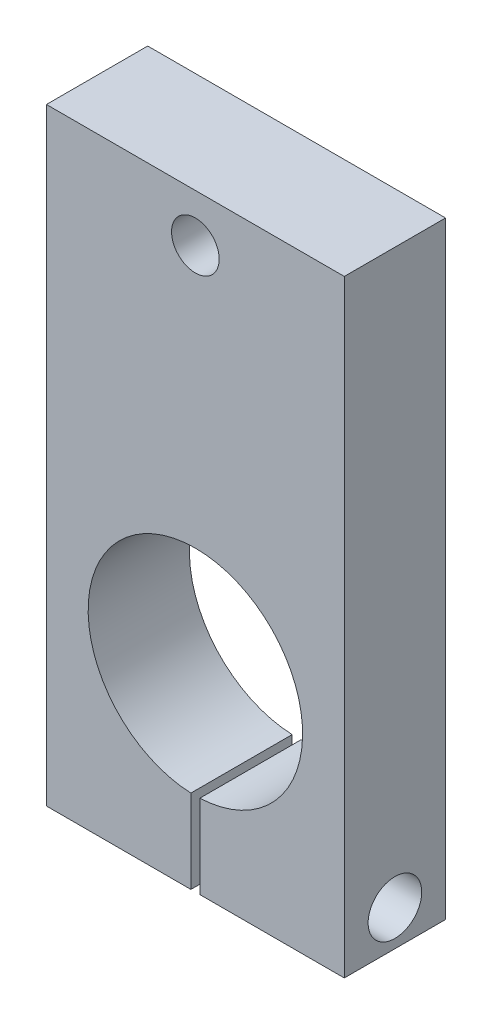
ISO-10303-21;
HEADER;
FILE_DESCRIPTION(('STEP AP214'),'2;1');
FILE_NAME('part.step','',(''),(''),'','','');
FILE_SCHEMA(('AUTOMOTIVE_DESIGN { 1 0 10303 214 1 1 1 1 }'));
ENDSEC;
DATA;
#1=APPLICATION_CONTEXT('core data for automotive mechanical design processes');
#2=APPLICATION_PROTOCOL_DEFINITION('international standard','automotive_design',2000,#1);
#3=PRODUCT_CONTEXT('',#1,'mechanical');
#4=PRODUCT('Part','Part','',(#3));
#5=PRODUCT_RELATED_PRODUCT_CATEGORY('part','',(#4));
#6=PRODUCT_DEFINITION_FORMATION('','',#4);
#7=PRODUCT_DEFINITION_CONTEXT('part definition',#1,'design');
#8=PRODUCT_DEFINITION('design','',#6,#7);
#9=PRODUCT_DEFINITION_SHAPE('','',#8);
#10=(LENGTH_UNIT() NAMED_UNIT(*) SI_UNIT(.MILLI.,.METRE.));
#11=(NAMED_UNIT(*) PLANE_ANGLE_UNIT() SI_UNIT($,.RADIAN.));
#12=(NAMED_UNIT(*) SI_UNIT($,.STERADIAN.) SOLID_ANGLE_UNIT());
#13=UNCERTAINTY_MEASURE_WITH_UNIT(LENGTH_MEASURE(1.E-05),#10,'distance_accuracy_value','');
#14=(GEOMETRIC_REPRESENTATION_CONTEXT(3) GLOBAL_UNCERTAINTY_ASSIGNED_CONTEXT((#13)) GLOBAL_UNIT_ASSIGNED_CONTEXT((#10,
#11,#12)) REPRESENTATION_CONTEXT('',''));
#15=CARTESIAN_POINT('',(0.,0.,0.));
#16=DIRECTION('',(0.,0.,1.));
#17=DIRECTION('',(1.,0.,0.));
#18=AXIS2_PLACEMENT_3D('',#15,#16,#17);
#19=CARTESIAN_POINT('',(12.,-26.,8.5));
#20=DIRECTION('',(-1.,0.,0.));
#21=DIRECTION('',(0.,-1.,0.));
#22=AXIS2_PLACEMENT_3D('',#19,#20,#21);
#23=PLANE('',#22);
#24=CARTESIAN_POINT('',(12.,-26.,8.5));
#25=DIRECTION('',(1.,0.,0.));
#26=DIRECTION('',(0.,1.,0.));
#27=AXIS2_PLACEMENT_3D('',#24,#25,#26);
#28=CIRCLE('',#27,3.);
#29=CARTESIAN_POINT('',(12.,-23.,8.5));
#30=VERTEX_POINT('',#29);
#31=EDGE_CURVE('E20',#30,#30,#28,.F.);
#32=ORIENTED_EDGE('',*,*,#31,.T.);
#33=EDGE_LOOP('',(#32));
#34=FACE_BOUND('',#33,.T.);
#35=CARTESIAN_POINT('',(12.,-26.,8.5));
#36=DIRECTION('',(1.,0.,0.));
#37=DIRECTION('',(0.,1.,0.));
#38=AXIS2_PLACEMENT_3D('',#35,#36,#37);
#39=CIRCLE('',#38,4.5);
#40=CARTESIAN_POINT('',(12.,-21.5,8.5));
#41=VERTEX_POINT('',#40);
#42=EDGE_CURVE('E179',#41,#41,#39,.T.);
#43=ORIENTED_EDGE('',*,*,#42,.T.);
#44=EDGE_LOOP('',(#43));
#45=FACE_BOUND('',#44,.T.);
#46=ADVANCED_FACE('F16',(#34,#45),#23,.F.);
#47=CARTESIAN_POINT('',(12.5,-26.,8.5));
#48=DIRECTION('',(1.,0.,0.));
#49=DIRECTION('',(0.,1.,0.));
#50=AXIS2_PLACEMENT_3D('',#47,#48,#49);
#51=CYLINDRICAL_SURFACE('',#50,3.);
#52=ORIENTED_EDGE('',*,*,#31,.F.);
#53=EDGE_LOOP('',(#52));
#54=FACE_BOUND('',#53,.T.);
#55=CARTESIAN_POINT('',(0.750000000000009,-26.,8.5));
#56=DIRECTION('',(1.,0.,0.));
#57=DIRECTION('',(0.,1.,0.));
#58=AXIS2_PLACEMENT_3D('',#55,#56,#57);
#59=CIRCLE('',#58,3.);
#60=CARTESIAN_POINT('',(0.750000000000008,-23.,8.5));
#61=VERTEX_POINT('',#60);
#62=EDGE_CURVE('E109',#61,#61,#59,.T.);
#63=ORIENTED_EDGE('',*,*,#62,.F.);
#64=EDGE_LOOP('',(#63));
#65=FACE_BOUND('',#64,.T.);
#66=ADVANCED_FACE('F187',(#54,#65),#51,.F.);
#67=CARTESIAN_POINT('',(18.5,-26.,8.5));
#68=DIRECTION('',(1.,0.,0.));
#69=DIRECTION('',(0.,1.,0.));
#70=AXIS2_PLACEMENT_3D('',#67,#68,#69);
#71=CYLINDRICAL_SURFACE('',#70,4.5);
#72=CARTESIAN_POINT('',(25.,-26.,8.5));
#73=DIRECTION('',(1.,0.,0.));
#74=DIRECTION('',(0.,1.,0.));
#75=AXIS2_PLACEMENT_3D('',#72,#73,#74);
#76=CIRCLE('',#75,4.5);
#77=CARTESIAN_POINT('',(25.,-21.5,8.5));
#78=VERTEX_POINT('',#77);
#79=EDGE_CURVE('E149',#78,#78,#76,.F.);
#80=ORIENTED_EDGE('',*,*,#79,.F.);
#81=EDGE_LOOP('',(#80));
#82=FACE_BOUND('',#81,.T.);
#83=ORIENTED_EDGE('',*,*,#42,.F.);
#84=EDGE_LOOP('',(#83));
#85=FACE_BOUND('',#84,.T.);
#86=ADVANCED_FACE('F190',(#82,#85),#71,.F.);
#87=CARTESIAN_POINT('',(-12.5,-26.,8.5));
#88=DIRECTION('',(-1.,0.,0.));
#89=DIRECTION('',(0.,-1.,0.));
#90=AXIS2_PLACEMENT_3D('',#87,#88,#89);
#91=CYLINDRICAL_SURFACE('',#90,2.067);
#92=CARTESIAN_POINT('',(-25.,-26.,8.5));
#93=DIRECTION('',(-1.,0.,0.));
#94=DIRECTION('',(0.,-1.,0.));
#95=AXIS2_PLACEMENT_3D('',#92,#93,#94);
#96=CIRCLE('',#95,2.067);
#97=CARTESIAN_POINT('',(-25.,-28.067,8.5));
#98=VERTEX_POINT('',#97);
#99=EDGE_CURVE('E132',#98,#98,#96,.F.);
#100=ORIENTED_EDGE('',*,*,#99,.F.);
#101=EDGE_LOOP('',(#100));
#102=FACE_BOUND('',#101,.T.);
#103=CARTESIAN_POINT('',(-0.749999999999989,-26.,8.5));
#104=DIRECTION('',(-1.,0.,0.));
#105=DIRECTION('',(0.,-1.,0.));
#106=AXIS2_PLACEMENT_3D('',#103,#104,#105);
#107=CIRCLE('',#106,2.067);
#108=CARTESIAN_POINT('',(-0.749999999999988,-28.067,8.5));
#109=VERTEX_POINT('',#108);
#110=EDGE_CURVE('E103',#109,#109,#107,.T.);
#111=ORIENTED_EDGE('',*,*,#110,.F.);
#112=EDGE_LOOP('',(#111));
#113=FACE_BOUND('',#112,.T.);
#114=ADVANCED_FACE('F226',(#102,#113),#91,.F.);
#115=CARTESIAN_POINT('',(0.,11.2291808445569,17.));
#116=DIRECTION('',(0.,0.,1.));
#117=DIRECTION('',(1.,0.,0.));
#118=AXIS2_PLACEMENT_3D('',#115,#116,#117);
#119=PLANE('',#118);
#120=DIRECTION('',(0.,1.,0.));
#121=VECTOR('',#120,1.);
#122=CARTESIAN_POINT('',(25.,70.,17.));
#123=LINE('',#122,#121);
#124=CARTESIAN_POINT('',(25.,70.,17.));
#125=VERTEX_POINT('',#124);
#126=CARTESIAN_POINT('',(25.,-32.,17.));
#127=VERTEX_POINT('',#126);
#128=EDGE_CURVE('E147',#125,#127,#123,.F.);
#129=ORIENTED_EDGE('',*,*,#128,.F.);
#130=DIRECTION('',(1.,0.,0.));
#131=VECTOR('',#130,1.);
#132=CARTESIAN_POINT('',(-25.,70.,17.));
#133=LINE('',#132,#131);
#134=CARTESIAN_POINT('',(-25.,70.,17.));
#135=VERTEX_POINT('',#134);
#136=EDGE_CURVE('E138',#135,#125,#133,.T.);
#137=ORIENTED_EDGE('',*,*,#136,.F.);
#138=DIRECTION('',(0.,-1.,0.));
#139=VECTOR('',#138,1.);
#140=CARTESIAN_POINT('',(-25.,-32.,17.));
#141=LINE('',#140,#139);
#142=CARTESIAN_POINT('',(-25.,-32.,17.));
#143=VERTEX_POINT('',#142);
#144=EDGE_CURVE('E130',#143,#135,#141,.F.);
#145=ORIENTED_EDGE('',*,*,#144,.F.);
#146=DIRECTION('',(1.,0.,0.));
#147=VECTOR('',#146,1.);
#148=CARTESIAN_POINT('',(-0.749999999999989,-32.,17.));
#149=LINE('',#148,#147);
#150=CARTESIAN_POINT('',(-0.749999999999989,-32.,17.));
#151=VERTEX_POINT('',#150);
#152=EDGE_CURVE('E99',#151,#143,#149,.F.);
#153=ORIENTED_EDGE('',*,*,#152,.F.);
#154=DIRECTION('',(0.,1.,0.));
#155=VECTOR('',#154,1.);
#156=CARTESIAN_POINT('',(-0.74999999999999,-17.9843682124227,17.));
#157=LINE('',#156,#155);
#158=CARTESIAN_POINT('',(-0.749999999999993,-17.9843682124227,17.));
#159=VERTEX_POINT('',#158);
#160=EDGE_CURVE('E92',#159,#151,#157,.F.);
#161=ORIENTED_EDGE('',*,*,#160,.F.);
#162=CARTESIAN_POINT('',(0.,0.,17.));
#163=DIRECTION('',(0.,0.,1.));
#164=DIRECTION('',(1.,0.,0.));
#165=AXIS2_PLACEMENT_3D('',#162,#163,#164);
#166=CIRCLE('',#165,18.);
#167=CARTESIAN_POINT('',(0.750000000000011,-17.9843682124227,17.));
#168=VERTEX_POINT('',#167);
#169=EDGE_CURVE('E83',#168,#159,#166,.T.);
#170=ORIENTED_EDGE('',*,*,#169,.F.);
#171=DIRECTION('',(0.,-1.,0.));
#172=VECTOR('',#171,1.);
#173=CARTESIAN_POINT('',(0.750000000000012,-32.,17.));
#174=LINE('',#173,#172);
#175=CARTESIAN_POINT('',(0.750000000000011,-32.,17.));
#176=VERTEX_POINT('',#175);
#177=EDGE_CURVE('E78',#176,#168,#174,.F.);
#178=ORIENTED_EDGE('',*,*,#177,.F.);
#179=DIRECTION('',(1.,0.,0.));
#180=VECTOR('',#179,1.);
#181=CARTESIAN_POINT('',(25.,-32.,17.));
#182=LINE('',#181,#180);
#183=EDGE_CURVE('E155',#127,#176,#182,.F.);
#184=ORIENTED_EDGE('',*,*,#183,.F.);
#185=EDGE_LOOP('',(#129,#137,#145,#153,#161,#170,#178,#184));
#186=FACE_BOUND('',#185,.T.);
#187=CARTESIAN_POINT('',(0.,62.,17.));
#188=DIRECTION('',(0.,0.,1.));
#189=DIRECTION('',(1.,0.,0.));
#190=AXIS2_PLACEMENT_3D('',#187,#188,#189);
#191=CIRCLE('',#190,4.);
#192=CARTESIAN_POINT('',(4.,62.,17.));
#193=VERTEX_POINT('',#192);
#194=EDGE_CURVE('E177',#193,#193,#191,.F.);
#195=ORIENTED_EDGE('',*,*,#194,.T.);
#196=EDGE_LOOP('',(#195));
#197=FACE_BOUND('',#196,.T.);
#198=ADVANCED_FACE('F96',(#186,#197),#119,.T.);
#199=CARTESIAN_POINT('',(0.,62.,0.));
#200=DIRECTION('',(0.,0.,1.));
#201=DIRECTION('',(1.,0.,0.));
#202=AXIS2_PLACEMENT_3D('',#199,#200,#201);
#203=CYLINDRICAL_SURFACE('',#202,4.);
#204=CARTESIAN_POINT('',(0.,62.,0.));
#205=DIRECTION('',(0.,0.,1.));
#206=DIRECTION('',(1.,0.,0.));
#207=AXIS2_PLACEMENT_3D('',#204,#205,#206);
#208=CIRCLE('',#207,4.);
#209=CARTESIAN_POINT('',(4.,62.,0.));
#210=VERTEX_POINT('',#209);
#211=EDGE_CURVE('E119',#210,#210,#208,.F.);
#212=ORIENTED_EDGE('',*,*,#211,.T.);
#213=EDGE_LOOP('',(#212));
#214=FACE_BOUND('',#213,.T.);
#215=ORIENTED_EDGE('',*,*,#194,.F.);
#216=EDGE_LOOP('',(#215));
#217=FACE_BOUND('',#216,.T.);
#218=ADVANCED_FACE('F220',(#214,#217),#203,.F.);
#219=CARTESIAN_POINT('',(-0.74999999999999,-17.9843682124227,0.));
#220=DIRECTION('',(1.,0.,0.));
#221=DIRECTION('',(0.,0.,-1.));
#222=AXIS2_PLACEMENT_3D('',#219,#220,#221);
#223=PLANE('',#222);
#224=DIRECTION('',(0.,1.,0.));
#225=VECTOR('',#224,1.);
#226=CARTESIAN_POINT('',(-0.749999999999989,11.2291808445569,0.));
#227=LINE('',#226,#225);
#228=CARTESIAN_POINT('',(-0.749999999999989,-32.,0.));
#229=VERTEX_POINT('',#228);
#230=CARTESIAN_POINT('',(-0.749999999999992,-17.9843682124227,0.));
#231=VERTEX_POINT('',#230);
#232=EDGE_CURVE('E108',#229,#231,#227,.T.);
#233=ORIENTED_EDGE('',*,*,#232,.T.);
#234=DIRECTION('',(0.,0.,1.));
#235=VECTOR('',#234,1.);
#236=CARTESIAN_POINT('',(-0.749999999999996,-17.9843682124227,0.));
#237=LINE('',#236,#235);
#238=EDGE_CURVE('E88',#159,#231,#237,.F.);
#239=ORIENTED_EDGE('',*,*,#238,.F.);
#240=ORIENTED_EDGE('',*,*,#160,.T.);
#241=DIRECTION('',(0.,0.,1.));
#242=VECTOR('',#241,1.);
#243=CARTESIAN_POINT('',(-0.749999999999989,-32.,0.));
#244=LINE('',#243,#242);
#245=EDGE_CURVE('E117',#229,#151,#244,.T.);
#246=ORIENTED_EDGE('',*,*,#245,.F.);
#247=EDGE_LOOP('',(#233,#239,#240,#246));
#248=FACE_BOUND('',#247,.T.);
#249=ORIENTED_EDGE('',*,*,#110,.T.);
#250=EDGE_LOOP('',(#249));
#251=FACE_BOUND('',#250,.T.);
#252=ADVANCED_FACE('F106',(#248,#251),#223,.T.);
#253=CARTESIAN_POINT('',(0.,0.,0.));
#254=DIRECTION('',(0.,0.,1.));
#255=DIRECTION('',(1.,0.,0.));
#256=AXIS2_PLACEMENT_3D('',#253,#254,#255);
#257=CYLINDRICAL_SURFACE('',#256,18.);
#258=CARTESIAN_POINT('',(0.,0.,0.));
#259=DIRECTION('',(0.,0.,1.));
#260=DIRECTION('',(1.,0.,0.));
#261=AXIS2_PLACEMENT_3D('',#258,#259,#260);
#262=CIRCLE('',#261,18.);
#263=CARTESIAN_POINT('',(0.750000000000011,-17.9843682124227,0.));
#264=VERTEX_POINT('',#263);
#265=EDGE_CURVE('E166',#231,#264,#262,.F.);
#266=ORIENTED_EDGE('',*,*,#265,.T.);
#267=DIRECTION('',(0.,0.,1.));
#268=VECTOR('',#267,1.);
#269=CARTESIAN_POINT('',(0.750000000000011,-17.9843682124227,0.));
#270=LINE('',#269,#268);
#271=EDGE_CURVE('E90',#168,#264,#270,.F.);
#272=ORIENTED_EDGE('',*,*,#271,.F.);
#273=ORIENTED_EDGE('',*,*,#169,.T.);
#274=ORIENTED_EDGE('',*,*,#238,.T.);
#275=EDGE_LOOP('',(#266,#272,#273,#274));
#276=FACE_BOUND('',#275,.T.);
#277=ADVANCED_FACE('F86',(#276),#257,.F.);
#278=CARTESIAN_POINT('',(0.750000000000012,-32.,0.));
#279=DIRECTION('',(-1.,0.,0.));
#280=DIRECTION('',(0.,-1.,0.));
#281=AXIS2_PLACEMENT_3D('',#278,#279,#280);
#282=PLANE('',#281);
#283=DIRECTION('',(0.,1.,0.));
#284=VECTOR('',#283,1.);
#285=CARTESIAN_POINT('',(0.750000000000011,11.2291808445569,0.));
#286=LINE('',#285,#284);
#287=CARTESIAN_POINT('',(0.750000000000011,-32.,0.));
#288=VERTEX_POINT('',#287);
#289=EDGE_CURVE('E168',#264,#288,#286,.F.);
#290=ORIENTED_EDGE('',*,*,#289,.T.);
#291=DIRECTION('',(0.,0.,1.));
#292=VECTOR('',#291,1.);
#293=CARTESIAN_POINT('',(0.750000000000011,-32.,0.));
#294=LINE('',#293,#292);
#295=EDGE_CURVE('E157',#176,#288,#294,.F.);
#296=ORIENTED_EDGE('',*,*,#295,.F.);
#297=ORIENTED_EDGE('',*,*,#177,.T.);
#298=ORIENTED_EDGE('',*,*,#271,.T.);
#299=EDGE_LOOP('',(#290,#296,#297,#298));
#300=FACE_BOUND('',#299,.T.);
#301=ORIENTED_EDGE('',*,*,#62,.T.);
#302=EDGE_LOOP('',(#301));
#303=FACE_BOUND('',#302,.T.);
#304=ADVANCED_FACE('F194',(#300,#303),#282,.T.);
#305=CARTESIAN_POINT('',(25.,-32.,0.));
#306=DIRECTION('',(0.,-1.,0.));
#307=DIRECTION('',(1.,0.,0.));
#308=AXIS2_PLACEMENT_3D('',#305,#306,#307);
#309=PLANE('',#308);
#310=DIRECTION('',(1.,0.,0.));
#311=VECTOR('',#310,1.);
#312=CARTESIAN_POINT('',(0.,-32.,0.));
#313=LINE('',#312,#311);
#314=CARTESIAN_POINT('',(25.,-32.,0.));
#315=VERTEX_POINT('',#314);
#316=EDGE_CURVE('E273',#288,#315,#313,.T.);
#317=ORIENTED_EDGE('',*,*,#316,.T.);
#318=DIRECTION('',(0.,0.,-1.));
#319=VECTOR('',#318,1.);
#320=CARTESIAN_POINT('',(25.,-32.,0.));
#321=LINE('',#320,#319);
#322=EDGE_CURVE('E141',#127,#315,#321,.T.);
#323=ORIENTED_EDGE('',*,*,#322,.F.);
#324=ORIENTED_EDGE('',*,*,#183,.T.);
#325=ORIENTED_EDGE('',*,*,#295,.T.);
#326=EDGE_LOOP('',(#317,#323,#324,#325));
#327=FACE_BOUND('',#326,.T.);
#328=ADVANCED_FACE('F196',(#327),#309,.T.);
#329=CARTESIAN_POINT('',(25.,70.,0.));
#330=DIRECTION('',(1.,0.,0.));
#331=DIRECTION('',(0.,0.,-1.));
#332=AXIS2_PLACEMENT_3D('',#329,#330,#331);
#333=PLANE('',#332);
#334=DIRECTION('',(0.,1.,0.));
#335=VECTOR('',#334,1.);
#336=CARTESIAN_POINT('',(25.,11.2291808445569,0.));
#337=LINE('',#336,#335);
#338=CARTESIAN_POINT('',(25.,70.,0.));
#339=VERTEX_POINT('',#338);
#340=EDGE_CURVE('E268',#315,#339,#337,.T.);
#341=ORIENTED_EDGE('',*,*,#340,.T.);
#342=DIRECTION('',(0.,0.,1.));
#343=VECTOR('',#342,1.);
#344=CARTESIAN_POINT('',(25.,70.,0.));
#345=LINE('',#344,#343);
#346=EDGE_CURVE('E140',#125,#339,#345,.F.);
#347=ORIENTED_EDGE('',*,*,#346,.F.);
#348=ORIENTED_EDGE('',*,*,#128,.T.);
#349=ORIENTED_EDGE('',*,*,#322,.T.);
#350=EDGE_LOOP('',(#341,#347,#348,#349));
#351=FACE_BOUND('',#350,.T.);
#352=ORIENTED_EDGE('',*,*,#79,.T.);
#353=EDGE_LOOP('',(#352));
#354=FACE_BOUND('',#353,.T.);
#355=ADVANCED_FACE('F201',(#351,#354),#333,.T.);
#356=CARTESIAN_POINT('',(-25.,70.,0.));
#357=DIRECTION('',(0.,1.,0.));
#358=DIRECTION('',(0.,0.,1.));
#359=AXIS2_PLACEMENT_3D('',#356,#357,#358);
#360=PLANE('',#359);
#361=DIRECTION('',(1.,0.,0.));
#362=VECTOR('',#361,1.);
#363=CARTESIAN_POINT('',(0.,70.,0.));
#364=LINE('',#363,#362);
#365=CARTESIAN_POINT('',(-25.,70.,0.));
#366=VERTEX_POINT('',#365);
#367=EDGE_CURVE('E266',#339,#366,#364,.F.);
#368=ORIENTED_EDGE('',*,*,#367,.T.);
#369=DIRECTION('',(0.,0.,1.));
#370=VECTOR('',#369,1.);
#371=CARTESIAN_POINT('',(-25.,70.,0.));
#372=LINE('',#371,#370);
#373=EDGE_CURVE('E127',#135,#366,#372,.F.);
#374=ORIENTED_EDGE('',*,*,#373,.F.);
#375=ORIENTED_EDGE('',*,*,#136,.T.);
#376=ORIENTED_EDGE('',*,*,#346,.T.);
#377=EDGE_LOOP('',(#368,#374,#375,#376));
#378=FACE_BOUND('',#377,.T.);
#379=ADVANCED_FACE('F242',(#378),#360,.T.);
#380=CARTESIAN_POINT('',(-25.,-32.,0.));
#381=DIRECTION('',(-1.,0.,0.));
#382=DIRECTION('',(0.,-1.,0.));
#383=AXIS2_PLACEMENT_3D('',#380,#381,#382);
#384=PLANE('',#383);
#385=DIRECTION('',(0.,1.,0.));
#386=VECTOR('',#385,1.);
#387=CARTESIAN_POINT('',(-25.,11.2291808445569,0.));
#388=LINE('',#387,#386);
#389=CARTESIAN_POINT('',(-25.,-32.,0.));
#390=VERTEX_POINT('',#389);
#391=EDGE_CURVE('E26',#366,#390,#388,.F.);
#392=ORIENTED_EDGE('',*,*,#391,.T.);
#393=DIRECTION('',(0.,0.,1.));
#394=VECTOR('',#393,1.);
#395=CARTESIAN_POINT('',(-25.,-32.,0.));
#396=LINE('',#395,#394);
#397=EDGE_CURVE('E34',#143,#390,#396,.F.);
#398=ORIENTED_EDGE('',*,*,#397,.F.);
#399=ORIENTED_EDGE('',*,*,#144,.T.);
#400=ORIENTED_EDGE('',*,*,#373,.T.);
#401=EDGE_LOOP('',(#392,#398,#399,#400));
#402=FACE_BOUND('',#401,.T.);
#403=ORIENTED_EDGE('',*,*,#99,.T.);
#404=EDGE_LOOP('',(#403));
#405=FACE_BOUND('',#404,.T.);
#406=ADVANCED_FACE('F212',(#402,#405),#384,.T.);
#407=CARTESIAN_POINT('',(-0.749999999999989,-32.,0.));
#408=DIRECTION('',(0.,-1.,0.));
#409=DIRECTION('',(1.,0.,0.));
#410=AXIS2_PLACEMENT_3D('',#407,#408,#409);
#411=PLANE('',#410);
#412=DIRECTION('',(1.,0.,0.));
#413=VECTOR('',#412,1.);
#414=CARTESIAN_POINT('',(0.,-32.,0.));
#415=LINE('',#414,#413);
#416=EDGE_CURVE('E10',#390,#229,#415,.T.);
#417=ORIENTED_EDGE('',*,*,#416,.T.);
#418=ORIENTED_EDGE('',*,*,#245,.T.);
#419=ORIENTED_EDGE('',*,*,#152,.T.);
#420=ORIENTED_EDGE('',*,*,#397,.T.);
#421=EDGE_LOOP('',(#417,#418,#419,#420));
#422=FACE_BOUND('',#421,.T.);
#423=ADVANCED_FACE('F208',(#422),#411,.T.);
#424=CARTESIAN_POINT('',(0.,11.2291808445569,0.));
#425=DIRECTION('',(0.,0.,1.));
#426=DIRECTION('',(1.,0.,0.));
#427=AXIS2_PLACEMENT_3D('',#424,#425,#426);
#428=PLANE('',#427);
#429=ORIENTED_EDGE('',*,*,#391,.F.);
#430=ORIENTED_EDGE('',*,*,#367,.F.);
#431=ORIENTED_EDGE('',*,*,#340,.F.);
#432=ORIENTED_EDGE('',*,*,#316,.F.);
#433=ORIENTED_EDGE('',*,*,#289,.F.);
#434=ORIENTED_EDGE('',*,*,#265,.F.);
#435=ORIENTED_EDGE('',*,*,#232,.F.);
#436=ORIENTED_EDGE('',*,*,#416,.F.);
#437=EDGE_LOOP('',(#429,#430,#431,#432,#433,#434,#435,#436));
#438=FACE_BOUND('',#437,.T.);
#439=ORIENTED_EDGE('',*,*,#211,.F.);
#440=EDGE_LOOP('',(#439));
#441=FACE_BOUND('',#440,.T.);
#442=ADVANCED_FACE('F18',(#438,#441),#428,.F.);
#443=CLOSED_SHELL('',(#46,#66,#86,#114,#198,#218,#252,#277,#304,#328,#355,#379,#406,#423,#442));
#444=MANIFOLD_SOLID_BREP('B1',#443);
#445=ADVANCED_BREP_SHAPE_REPRESENTATION('',(#18,#444),#14);
#446=SHAPE_DEFINITION_REPRESENTATION(#9,#445);
ENDSEC;
END-ISO-10303-21;
